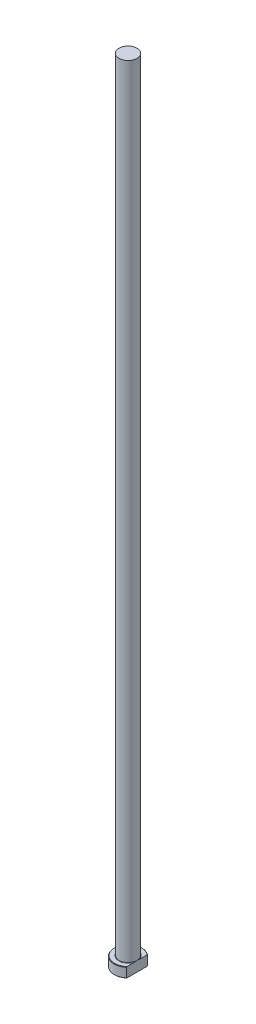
from build123d import *
from build123d.topology import SkipClean

# Parameters (mm, degrees)
CHAMFER1_SIZE = 0.2
FILLET1_R     = 0.2
KEY_DEPTH     = 401.122481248


with BuildPart() as part:
    # Sketch1 → Revolve1 (revolve)
    with BuildSketch(Plane.XY, mode=Mode.PRIVATE) as revolve1_sk:
        Polygon((0, 0), (-7, 0), (-7, 5), (-4.5, 5), (-4.5, 400), (0, 400), align=None)
    revolve(revolve1_sk.sketch.rotate(Axis((0, 259.958771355, 0), (0, -1, 0)), 270), axis=Axis((0, 259.958771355, 0), (0, -1, 0)))

    # Chamfer1
    chamfer1_edges = [part.edges().sort_by_distance(p)[0] for p in [
        (0, 5, -7),
        (0, 0, -7),
    ]]
    chamfer(chamfer1_edges, length=CHAMFER1_SIZE)

    # Fillet1
    fillet1_edges = [part.edges().sort_by_distance(p)[0] for p in [
        (0, 5, -4.5),
    ]]
    fillet(fillet1_edges, radius=FILLET1_R)

    # Sketch2 → KEY (cut, through all)
    with SkipClean():  # the faces are left unmerged after this step: merging them gives an invalid solid
        with BuildSketch(Plane(origin=(0, 0, 0), x_dir=(1, 0, 0), z_dir=(0, 1, 0))):
            with BuildLine():
                Line((4.5, 5.361902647), (4.5, -5.361902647))
                ThreePointArc((4.5, -5.361902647), (7, 0), (4.5, 5.361902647))
            make_face()
        extrude(amount=KEY_DEPTH, mode=Mode.SUBTRACT)


solid = part.part
